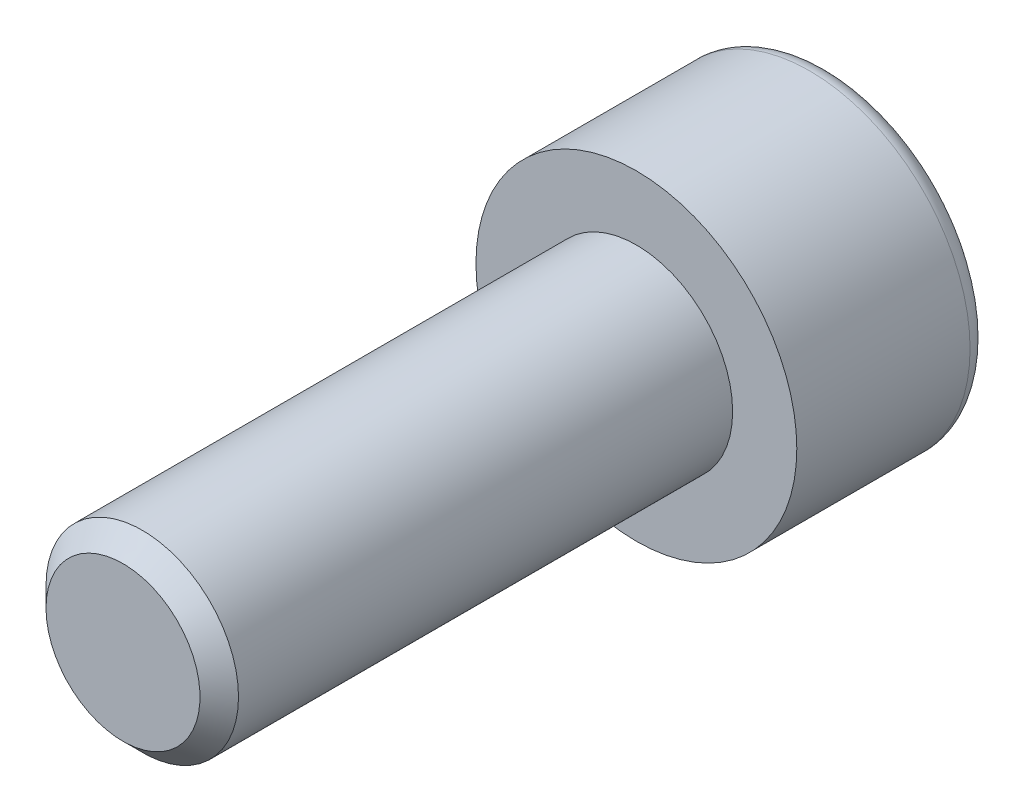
from build123d import *

# Parameters (mm, degrees)
ENLEV_MAT_EXTRU1_DEPTH = 3
ESQUISSE3_W            = 3
ESQUISSE3_H            = 16
CHANFREIN1_SIZE        = 0.6


with BuildPart() as part:
    # Esquisse1 → Base-R_volution (revolve)
    with BuildSketch(Plane(origin=(0, 0, 0), x_dir=(1, 0, 0), z_dir=(0, 1, 0)), mode=Mode.PRIVATE) as base_r_volution_sk:
        with BuildLine():
            Line((0, 0), (5, 0))
            Line((5, 0), (5, 5.4))
            ThreePointArc((5, 5.4), (4.824264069, 5.824264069), (4.4, 6))
            Line((4.4, 6), (0, 6))
            Line((0, 6), (0, 0))
        make_face()
    revolve(base_r_volution_sk.sketch.rotate(Axis((0, 0, 0), (0, 0, -1)), 180), axis=Axis((0, 0, 0), (0, 0, -1)))

    # Esquisse2 → enlev-mat-Extru1 (cut)
    with BuildSketch(Plane.XY.offset(-6)):
        Polygon((2.5, -1.443375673), (2.5, 1.443375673), (0, 2.886751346), (-2.5, 1.443375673), (-2.5, -1.443375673), (0, -2.886751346), align=None)
    extrude(amount=ENLEV_MAT_EXTRU1_DEPTH, mode=Mode.SUBTRACT)

    # Esquisse3 → Boss.-R_vol.1 (revolve)
    with BuildSketch(Plane(origin=(0, 0, 0), x_dir=(1, 0, 0), z_dir=(0, 1, 0))):
        with Locations((1.5, -8)):
            Rectangle(ESQUISSE3_W, ESQUISSE3_H)
    revolve(axis=Axis((0, 0, 0), (0, 0, 1)))

    # Chanfrein1
    chanfrein1_edges = [part.edges().sort_by_distance(p)[0] for p in [
        (-3, 0, 16),
    ]]
    chamfer(chanfrein1_edges, length=CHANFREIN1_SIZE)


solid = part.part
